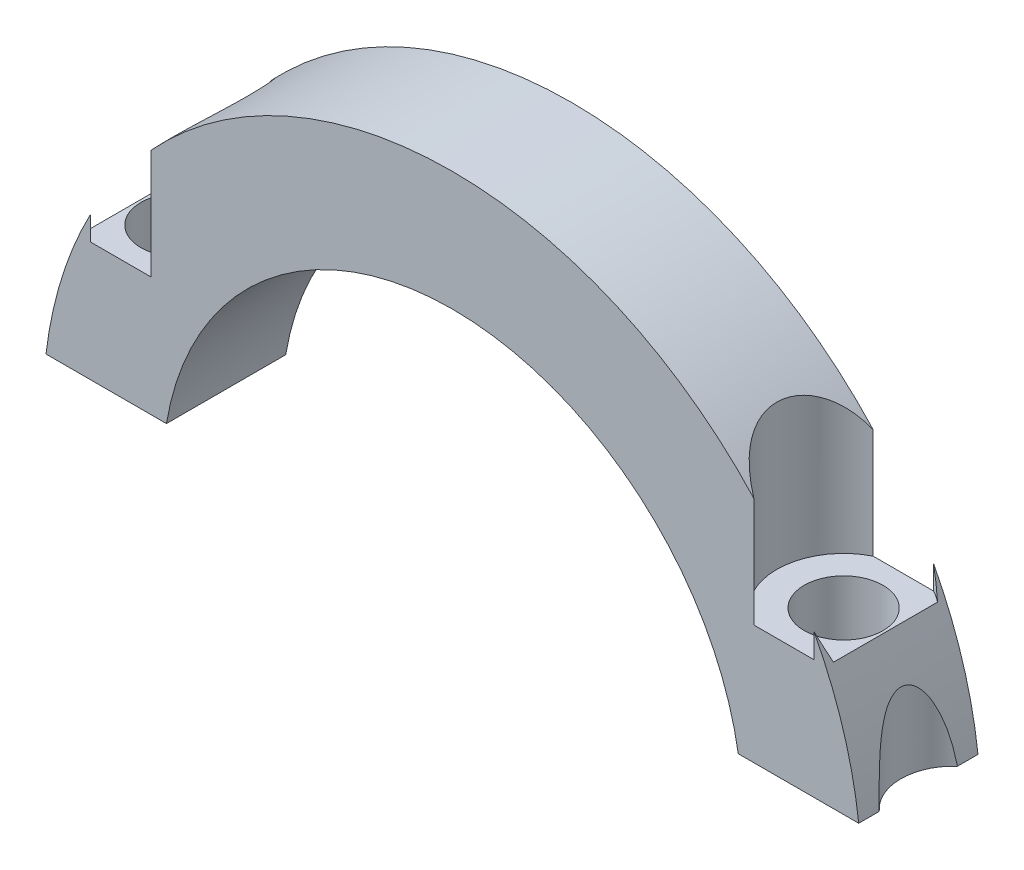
from build123d import *

# Parameters (mm, degrees)
BOSS_EXTRUDE1_DEPTH = 2.5
SKETCH2_R           = 1.65
SKETCH2_R_2         = 2.2
CUT_EXTRUDE1_DEPTH  = 23.932400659
SKETCH3_R           = 2.8
CUT_EXTRUDE2_DEPTH  = 20.984869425


with BuildPart() as part:
    # Sketch1 → Boss-Extrude1 (new, symmetric)
    with BuildSketch(Plane.XY):
        with BuildLine():
            Line((-11.984260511, 2), (-17.03298271, 2))
            ThreePointArc((-17.03298271, 2), (0, 17.15), (17.03298271, 2))
            Line((17.03298271, 2), (11.984260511, 2))
            ThreePointArc((11.984260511, 2), (0, 12.15), (-11.984260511, 2))
        make_face()
    extrude(amount=BOSS_EXTRUDE1_DEPTH, both=True)

    # Sketch2 → Cut-Extrude1 (cut, symmetric)
    with BuildSketch(Plane.XZ.offset(-2)):
        with Locations(Location((-13.9, 0, 0), (0, 0, 270))):
            Circle(SKETCH2_R)
        with Locations((-18.5, 0)):
            Circle(SKETCH2_R_2)
    cut_extrude1 = extrude(amount=CUT_EXTRUDE1_DEPTH, both=True, mode=Mode.SUBTRACT)

    # Sketch3 → Cut-Extrude2 (cut, through all)
    with BuildSketch(Plane(origin=(0, 7, 0), x_dir=(1, 0, 0), z_dir=(0, 1, 0))):
        with Locations((-13.9, 0)):
            Circle(SKETCH3_R)
    cut_extrude2 = extrude(amount=CUT_EXTRUDE2_DEPTH, mode=Mode.SUBTRACT)

    # Mirror1: Cut-Extrude1, Cut-Extrude2 across plane
    add(cut_extrude1.mirror(Plane(origin=(0, 0, 0), x_dir=(0, 0, 1), z_dir=(1, 0, 0))), mode=Mode.SUBTRACT)
    add(cut_extrude2.mirror(Plane(origin=(0, 0, 0), x_dir=(0, 0, 1), z_dir=(1, 0, 0))), mode=Mode.SUBTRACT)


solid = part.part
